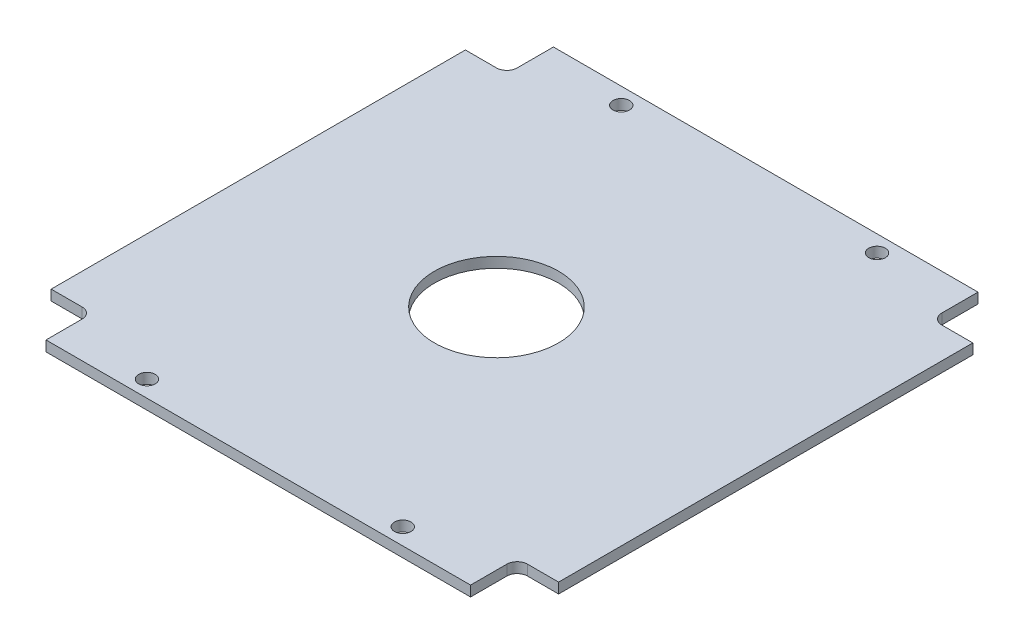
ISO-10303-21;
HEADER;
FILE_DESCRIPTION(('STEP AP214'),'2;1');
FILE_NAME('part.step','',(''),(''),'','','');
FILE_SCHEMA(('AUTOMOTIVE_DESIGN { 1 0 10303 214 1 1 1 1 }'));
ENDSEC;
DATA;
#1=APPLICATION_CONTEXT('core data for automotive mechanical design processes');
#2=APPLICATION_PROTOCOL_DEFINITION('international standard','automotive_design',2000,#1);
#3=PRODUCT_CONTEXT('',#1,'mechanical');
#4=PRODUCT('Part','Part','',(#3));
#5=PRODUCT_RELATED_PRODUCT_CATEGORY('part','',(#4));
#6=PRODUCT_DEFINITION_FORMATION('','',#4);
#7=PRODUCT_DEFINITION_CONTEXT('part definition',#1,'design');
#8=PRODUCT_DEFINITION('design','',#6,#7);
#9=PRODUCT_DEFINITION_SHAPE('','',#8);
#10=(LENGTH_UNIT() NAMED_UNIT(*) SI_UNIT(.MILLI.,.METRE.));
#11=(NAMED_UNIT(*) PLANE_ANGLE_UNIT() SI_UNIT($,.RADIAN.));
#12=(NAMED_UNIT(*) SI_UNIT($,.STERADIAN.) SOLID_ANGLE_UNIT());
#13=UNCERTAINTY_MEASURE_WITH_UNIT(LENGTH_MEASURE(1.E-05),#10,'distance_accuracy_value','');
#14=(GEOMETRIC_REPRESENTATION_CONTEXT(3) GLOBAL_UNCERTAINTY_ASSIGNED_CONTEXT((#13)) GLOBAL_UNIT_ASSIGNED_CONTEXT((#10,
#11,#12)) REPRESENTATION_CONTEXT('',''));
#15=CARTESIAN_POINT('',(0.,0.,0.));
#16=DIRECTION('',(0.,0.,1.));
#17=DIRECTION('',(1.,0.,0.));
#18=AXIS2_PLACEMENT_3D('',#15,#16,#17);
#19=CARTESIAN_POINT('',(-43.,2.,42.));
#20=DIRECTION('',(0.,-1.,0.));
#21=DIRECTION('',(0.,0.,-1.));
#22=AXIS2_PLACEMENT_3D('',#19,#20,#21);
#23=PLANE('',#22);
#24=CARTESIAN_POINT('',(-3.,2.,0.));
#25=DIRECTION('',(0.,-1.,0.));
#26=DIRECTION('',(0.,0.,-1.));
#27=AXIS2_PLACEMENT_3D('',#24,#25,#26);
#28=CIRCLE('',#27,12.);
#29=CARTESIAN_POINT('',(-3.,2.,-12.));
#30=VERTEX_POINT('',#29);
#31=EDGE_CURVE('E341',#30,#30,#28,.T.);
#32=ORIENTED_EDGE('',*,*,#31,.T.);
#33=EDGE_LOOP('',(#32));
#34=FACE_BOUND('',#33,.T.);
#35=DIRECTION('',(-1.,0.,0.));
#36=VECTOR('',#35,1.);
#37=CARTESIAN_POINT('',(-43.,2.,-40.));
#38=LINE('',#37,#36);
#39=CARTESIAN_POINT('',(-43.,2.,-40.));
#40=VERTEX_POINT('',#39);
#41=CARTESIAN_POINT('',(-49.,2.,-40.));
#42=VERTEX_POINT('',#41);
#43=EDGE_CURVE('E209',#40,#42,#38,.T.);
#44=ORIENTED_EDGE('',*,*,#43,.T.);
#45=DIRECTION('',(0.,0.,1.));
#46=VECTOR('',#45,1.);
#47=CARTESIAN_POINT('',(-49.,2.,-40.));
#48=LINE('',#47,#46);
#49=CARTESIAN_POINT('',(-49.,2.,40.));
#50=VERTEX_POINT('',#49);
#51=EDGE_CURVE('E117',#42,#50,#48,.T.);
#52=ORIENTED_EDGE('',*,*,#51,.T.);
#53=DIRECTION('',(1.,0.,0.));
#54=VECTOR('',#53,1.);
#55=CARTESIAN_POINT('',(-49.,2.,40.));
#56=LINE('',#55,#54);
#57=CARTESIAN_POINT('',(-43.,2.,40.));
#58=VERTEX_POINT('',#57);
#59=EDGE_CURVE('E248',#50,#58,#56,.T.);
#60=ORIENTED_EDGE('',*,*,#59,.T.);
#61=CARTESIAN_POINT('',(-43.,2.,42.));
#62=DIRECTION('',(0.,-1.,0.));
#63=DIRECTION('',(0.,0.,-1.));
#64=AXIS2_PLACEMENT_3D('',#61,#62,#63);
#65=CIRCLE('',#64,2.);
#66=CARTESIAN_POINT('',(-41.,2.,42.));
#67=VERTEX_POINT('',#66);
#68=EDGE_CURVE('E267',#58,#67,#65,.T.);
#69=ORIENTED_EDGE('',*,*,#68,.T.);
#70=DIRECTION('',(0.,0.,1.));
#71=VECTOR('',#70,1.);
#72=CARTESIAN_POINT('',(-41.,2.,42.));
#73=LINE('',#72,#71);
#74=CARTESIAN_POINT('',(-41.,2.,49.));
#75=VERTEX_POINT('',#74);
#76=EDGE_CURVE('E264',#67,#75,#73,.T.);
#77=ORIENTED_EDGE('',*,*,#76,.T.);
#78=DIRECTION('',(1.,0.,0.));
#79=VECTOR('',#78,1.);
#80=CARTESIAN_POINT('',(-41.,2.,49.));
#81=LINE('',#80,#79);
#82=CARTESIAN_POINT('',(41.,2.,49.));
#83=VERTEX_POINT('',#82);
#84=EDGE_CURVE('E266',#75,#83,#81,.T.);
#85=ORIENTED_EDGE('',*,*,#84,.T.);
#86=DIRECTION('',(0.,0.,-1.));
#87=VECTOR('',#86,1.);
#88=CARTESIAN_POINT('',(41.,2.,49.));
#89=LINE('',#88,#87);
#90=CARTESIAN_POINT('',(41.,2.,42.));
#91=VERTEX_POINT('',#90);
#92=EDGE_CURVE('E269',#83,#91,#89,.T.);
#93=ORIENTED_EDGE('',*,*,#92,.T.);
#94=CARTESIAN_POINT('',(43.,2.,42.));
#95=DIRECTION('',(0.,-1.,0.));
#96=DIRECTION('',(0.,0.,-1.));
#97=AXIS2_PLACEMENT_3D('',#94,#95,#96);
#98=CIRCLE('',#97,2.);
#99=CARTESIAN_POINT('',(43.,2.,40.));
#100=VERTEX_POINT('',#99);
#101=EDGE_CURVE('E275',#91,#100,#98,.T.);
#102=ORIENTED_EDGE('',*,*,#101,.T.);
#103=DIRECTION('',(1.,0.,0.));
#104=VECTOR('',#103,1.);
#105=CARTESIAN_POINT('',(43.,2.,40.));
#106=LINE('',#105,#104);
#107=CARTESIAN_POINT('',(49.,2.,40.));
#108=VERTEX_POINT('',#107);
#109=EDGE_CURVE('E277',#100,#108,#106,.T.);
#110=ORIENTED_EDGE('',*,*,#109,.T.);
#111=DIRECTION('',(0.,0.,-1.));
#112=VECTOR('',#111,1.);
#113=CARTESIAN_POINT('',(49.,2.,40.));
#114=LINE('',#113,#112);
#115=CARTESIAN_POINT('',(49.,2.,-40.));
#116=VERTEX_POINT('',#115);
#117=EDGE_CURVE('E279',#108,#116,#114,.T.);
#118=ORIENTED_EDGE('',*,*,#117,.T.);
#119=DIRECTION('',(-1.,0.,0.));
#120=VECTOR('',#119,1.);
#121=CARTESIAN_POINT('',(49.,2.,-40.));
#122=LINE('',#121,#120);
#123=CARTESIAN_POINT('',(43.,2.,-40.));
#124=VERTEX_POINT('',#123);
#125=EDGE_CURVE('E281',#116,#124,#122,.T.);
#126=ORIENTED_EDGE('',*,*,#125,.T.);
#127=CARTESIAN_POINT('',(43.,2.,-42.));
#128=DIRECTION('',(0.,-1.,0.));
#129=DIRECTION('',(0.,0.,-1.));
#130=AXIS2_PLACEMENT_3D('',#127,#128,#129);
#131=CIRCLE('',#130,2.);
#132=CARTESIAN_POINT('',(41.,2.,-42.));
#133=VERTEX_POINT('',#132);
#134=EDGE_CURVE('E283',#124,#133,#131,.T.);
#135=ORIENTED_EDGE('',*,*,#134,.T.);
#136=DIRECTION('',(0.,0.,-1.));
#137=VECTOR('',#136,1.);
#138=CARTESIAN_POINT('',(41.,2.,-42.));
#139=LINE('',#138,#137);
#140=CARTESIAN_POINT('',(41.,2.,-49.));
#141=VERTEX_POINT('',#140);
#142=EDGE_CURVE('E160',#133,#141,#139,.T.);
#143=ORIENTED_EDGE('',*,*,#142,.T.);
#144=DIRECTION('',(-1.,0.,0.));
#145=VECTOR('',#144,1.);
#146=CARTESIAN_POINT('',(41.,2.,-49.));
#147=LINE('',#146,#145);
#148=CARTESIAN_POINT('',(-41.,2.,-49.));
#149=VERTEX_POINT('',#148);
#150=EDGE_CURVE('E154',#141,#149,#147,.T.);
#151=ORIENTED_EDGE('',*,*,#150,.T.);
#152=DIRECTION('',(0.,0.,1.));
#153=VECTOR('',#152,1.);
#154=CARTESIAN_POINT('',(-41.,2.,-49.));
#155=LINE('',#154,#153);
#156=CARTESIAN_POINT('',(-41.,2.,-42.));
#157=VERTEX_POINT('',#156);
#158=EDGE_CURVE('E158',#149,#157,#155,.T.);
#159=ORIENTED_EDGE('',*,*,#158,.T.);
#160=CARTESIAN_POINT('',(-43.,2.,-42.));
#161=DIRECTION('',(0.,-1.,0.));
#162=DIRECTION('',(0.,0.,-1.));
#163=AXIS2_PLACEMENT_3D('',#160,#161,#162);
#164=CIRCLE('',#163,2.);
#165=EDGE_CURVE('E50',#157,#40,#164,.T.);
#166=ORIENTED_EDGE('',*,*,#165,.T.);
#167=EDGE_LOOP('',(#44,#52,#60,#69,#77,#85,#93,#102,#110,#118,#126,#135,#143,#151,#159,#166));
#168=FACE_BOUND('',#167,.T.);
#169=CARTESIAN_POINT('',(24.7,2.,45.8));
#170=DIRECTION('',(0.,1.,0.));
#171=DIRECTION('',(0.,0.,1.));
#172=AXIS2_PLACEMENT_3D('',#169,#170,#171);
#173=CIRCLE('',#172,1.59999999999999);
#174=CARTESIAN_POINT('',(24.7,2.,47.4));
#175=VERTEX_POINT('',#174);
#176=EDGE_CURVE('E363',#175,#175,#173,.T.);
#177=ORIENTED_EDGE('',*,*,#176,.F.);
#178=EDGE_LOOP('',(#177));
#179=FACE_BOUND('',#178,.T.);
#180=CARTESIAN_POINT('',(-24.7,2.,45.8));
#181=DIRECTION('',(0.,1.,0.));
#182=DIRECTION('',(0.,0.,1.));
#183=AXIS2_PLACEMENT_3D('',#180,#181,#182);
#184=CIRCLE('',#183,1.59999999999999);
#185=CARTESIAN_POINT('',(-24.7,2.,47.4));
#186=VERTEX_POINT('',#185);
#187=EDGE_CURVE('E357',#186,#186,#184,.T.);
#188=ORIENTED_EDGE('',*,*,#187,.F.);
#189=EDGE_LOOP('',(#188));
#190=FACE_BOUND('',#189,.T.);
#191=CARTESIAN_POINT('',(-24.7,2.,-45.8));
#192=DIRECTION('',(0.,1.,0.));
#193=DIRECTION('',(0.,0.,1.));
#194=AXIS2_PLACEMENT_3D('',#191,#192,#193);
#195=CIRCLE('',#194,1.59999999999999);
#196=CARTESIAN_POINT('',(-24.7,2.,-44.2));
#197=VERTEX_POINT('',#196);
#198=EDGE_CURVE('E351',#197,#197,#195,.T.);
#199=ORIENTED_EDGE('',*,*,#198,.F.);
#200=EDGE_LOOP('',(#199));
#201=FACE_BOUND('',#200,.T.);
#202=CARTESIAN_POINT('',(24.7,2.,-45.8));
#203=DIRECTION('',(0.,1.,0.));
#204=DIRECTION('',(0.,0.,1.));
#205=AXIS2_PLACEMENT_3D('',#202,#203,#204);
#206=CIRCLE('',#205,1.59999999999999);
#207=CARTESIAN_POINT('',(24.7,2.,-44.2));
#208=VERTEX_POINT('',#207);
#209=EDGE_CURVE('E342',#208,#208,#206,.T.);
#210=ORIENTED_EDGE('',*,*,#209,.F.);
#211=EDGE_LOOP('',(#210));
#212=FACE_BOUND('',#211,.T.);
#213=ADVANCED_FACE('F33',(#34,#168,#179,#190,#201,#212),#23,.F.);
#214=CARTESIAN_POINT('',(-43.,0.,42.));
#215=DIRECTION('',(0.,-1.,0.));
#216=DIRECTION('',(0.,0.,-1.));
#217=AXIS2_PLACEMENT_3D('',#214,#215,#216);
#218=PLANE('',#217);
#219=CARTESIAN_POINT('',(-3.,0.,0.));
#220=DIRECTION('',(0.,-1.,0.));
#221=DIRECTION('',(0.,0.,-1.));
#222=AXIS2_PLACEMENT_3D('',#219,#220,#221);
#223=CIRCLE('',#222,12.);
#224=CARTESIAN_POINT('',(-3.,0.,-12.));
#225=VERTEX_POINT('',#224);
#226=EDGE_CURVE('E339',#225,#225,#223,.T.);
#227=ORIENTED_EDGE('',*,*,#226,.F.);
#228=EDGE_LOOP('',(#227));
#229=FACE_BOUND('',#228,.T.);
#230=CARTESIAN_POINT('',(24.7,0.,-45.8));
#231=DIRECTION('',(0.,1.,0.));
#232=DIRECTION('',(0.,0.,1.));
#233=AXIS2_PLACEMENT_3D('',#230,#231,#232);
#234=CIRCLE('',#233,1.59999999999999);
#235=CARTESIAN_POINT('',(24.7,0.,-44.2));
#236=VERTEX_POINT('',#235);
#237=EDGE_CURVE('E345',#236,#236,#234,.T.);
#238=ORIENTED_EDGE('',*,*,#237,.T.);
#239=EDGE_LOOP('',(#238));
#240=FACE_BOUND('',#239,.T.);
#241=CARTESIAN_POINT('',(-24.7,0.,-45.8));
#242=DIRECTION('',(0.,1.,0.));
#243=DIRECTION('',(0.,0.,1.));
#244=AXIS2_PLACEMENT_3D('',#241,#242,#243);
#245=CIRCLE('',#244,1.59999999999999);
#246=CARTESIAN_POINT('',(-24.7,0.,-44.2));
#247=VERTEX_POINT('',#246);
#248=EDGE_CURVE('E354',#247,#247,#245,.T.);
#249=ORIENTED_EDGE('',*,*,#248,.T.);
#250=EDGE_LOOP('',(#249));
#251=FACE_BOUND('',#250,.T.);
#252=CARTESIAN_POINT('',(-24.7,0.,45.8));
#253=DIRECTION('',(0.,1.,0.));
#254=DIRECTION('',(0.,0.,1.));
#255=AXIS2_PLACEMENT_3D('',#252,#253,#254);
#256=CIRCLE('',#255,1.59999999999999);
#257=CARTESIAN_POINT('',(-24.7,0.,47.4));
#258=VERTEX_POINT('',#257);
#259=EDGE_CURVE('E360',#258,#258,#256,.T.);
#260=ORIENTED_EDGE('',*,*,#259,.T.);
#261=EDGE_LOOP('',(#260));
#262=FACE_BOUND('',#261,.T.);
#263=DIRECTION('',(-1.,0.,0.));
#264=VECTOR('',#263,1.);
#265=CARTESIAN_POINT('',(-43.,0.,-40.));
#266=LINE('',#265,#264);
#267=CARTESIAN_POINT('',(-43.,0.,-40.));
#268=VERTEX_POINT('',#267);
#269=CARTESIAN_POINT('',(-49.,0.,-40.));
#270=VERTEX_POINT('',#269);
#271=EDGE_CURVE('E178',#268,#270,#266,.T.);
#272=ORIENTED_EDGE('',*,*,#271,.F.);
#273=CARTESIAN_POINT('',(-43.,0.,-42.));
#274=DIRECTION('',(0.,-1.,0.));
#275=DIRECTION('',(0.,0.,-1.));
#276=AXIS2_PLACEMENT_3D('',#273,#274,#275);
#277=CIRCLE('',#276,2.);
#278=CARTESIAN_POINT('',(-41.,0.,-42.));
#279=VERTEX_POINT('',#278);
#280=EDGE_CURVE('E109',#279,#268,#277,.T.);
#281=ORIENTED_EDGE('',*,*,#280,.F.);
#282=DIRECTION('',(0.,0.,1.));
#283=VECTOR('',#282,1.);
#284=CARTESIAN_POINT('',(-41.,0.,-49.));
#285=LINE('',#284,#283);
#286=CARTESIAN_POINT('',(-41.,0.,-49.));
#287=VERTEX_POINT('',#286);
#288=EDGE_CURVE('E103',#287,#279,#285,.T.);
#289=ORIENTED_EDGE('',*,*,#288,.F.);
#290=DIRECTION('',(-1.,0.,0.));
#291=VECTOR('',#290,1.);
#292=CARTESIAN_POINT('',(41.,0.,-49.));
#293=LINE('',#292,#291);
#294=CARTESIAN_POINT('',(41.,0.,-49.));
#295=VERTEX_POINT('',#294);
#296=EDGE_CURVE('E168',#295,#287,#293,.T.);
#297=ORIENTED_EDGE('',*,*,#296,.F.);
#298=DIRECTION('',(0.,0.,-1.));
#299=VECTOR('',#298,1.);
#300=CARTESIAN_POINT('',(41.,0.,-42.));
#301=LINE('',#300,#299);
#302=CARTESIAN_POINT('',(41.,0.,-42.));
#303=VERTEX_POINT('',#302);
#304=EDGE_CURVE('E204',#303,#295,#301,.T.);
#305=ORIENTED_EDGE('',*,*,#304,.F.);
#306=CARTESIAN_POINT('',(43.,0.,-42.));
#307=DIRECTION('',(0.,-1.,0.));
#308=DIRECTION('',(0.,0.,-1.));
#309=AXIS2_PLACEMENT_3D('',#306,#307,#308);
#310=CIRCLE('',#309,2.);
#311=CARTESIAN_POINT('',(43.,0.,-40.));
#312=VERTEX_POINT('',#311);
#313=EDGE_CURVE('E202',#312,#303,#310,.T.);
#314=ORIENTED_EDGE('',*,*,#313,.F.);
#315=DIRECTION('',(-1.,0.,0.));
#316=VECTOR('',#315,1.);
#317=CARTESIAN_POINT('',(49.,0.,-40.));
#318=LINE('',#317,#316);
#319=CARTESIAN_POINT('',(49.,0.,-40.));
#320=VERTEX_POINT('',#319);
#321=EDGE_CURVE('E200',#320,#312,#318,.T.);
#322=ORIENTED_EDGE('',*,*,#321,.F.);
#323=DIRECTION('',(0.,0.,-1.));
#324=VECTOR('',#323,1.);
#325=CARTESIAN_POINT('',(49.,0.,40.));
#326=LINE('',#325,#324);
#327=CARTESIAN_POINT('',(49.,0.,40.));
#328=VERTEX_POINT('',#327);
#329=EDGE_CURVE('E198',#328,#320,#326,.T.);
#330=ORIENTED_EDGE('',*,*,#329,.F.);
#331=DIRECTION('',(1.,0.,0.));
#332=VECTOR('',#331,1.);
#333=CARTESIAN_POINT('',(43.,0.,40.));
#334=LINE('',#333,#332);
#335=CARTESIAN_POINT('',(43.,0.,40.));
#336=VERTEX_POINT('',#335);
#337=EDGE_CURVE('E196',#336,#328,#334,.T.);
#338=ORIENTED_EDGE('',*,*,#337,.F.);
#339=CARTESIAN_POINT('',(43.,0.,42.));
#340=DIRECTION('',(0.,-1.,0.));
#341=DIRECTION('',(0.,0.,-1.));
#342=AXIS2_PLACEMENT_3D('',#339,#340,#341);
#343=CIRCLE('',#342,2.);
#344=CARTESIAN_POINT('',(41.,0.,42.));
#345=VERTEX_POINT('',#344);
#346=EDGE_CURVE('E194',#345,#336,#343,.T.);
#347=ORIENTED_EDGE('',*,*,#346,.F.);
#348=DIRECTION('',(0.,0.,-1.));
#349=VECTOR('',#348,1.);
#350=CARTESIAN_POINT('',(41.,0.,49.));
#351=LINE('',#350,#349);
#352=CARTESIAN_POINT('',(41.,0.,49.));
#353=VERTEX_POINT('',#352);
#354=EDGE_CURVE('E192',#353,#345,#351,.T.);
#355=ORIENTED_EDGE('',*,*,#354,.F.);
#356=DIRECTION('',(1.,0.,0.));
#357=VECTOR('',#356,1.);
#358=CARTESIAN_POINT('',(-41.,0.,49.));
#359=LINE('',#358,#357);
#360=CARTESIAN_POINT('',(-41.,0.,49.));
#361=VERTEX_POINT('',#360);
#362=EDGE_CURVE('E190',#361,#353,#359,.T.);
#363=ORIENTED_EDGE('',*,*,#362,.F.);
#364=DIRECTION('',(0.,0.,1.));
#365=VECTOR('',#364,1.);
#366=CARTESIAN_POINT('',(-41.,0.,42.));
#367=LINE('',#366,#365);
#368=CARTESIAN_POINT('',(-41.,0.,42.));
#369=VERTEX_POINT('',#368);
#370=EDGE_CURVE('E188',#369,#361,#367,.T.);
#371=ORIENTED_EDGE('',*,*,#370,.F.);
#372=CARTESIAN_POINT('',(-43.,0.,42.));
#373=DIRECTION('',(0.,-1.,0.));
#374=DIRECTION('',(0.,0.,-1.));
#375=AXIS2_PLACEMENT_3D('',#372,#373,#374);
#376=CIRCLE('',#375,2.);
#377=CARTESIAN_POINT('',(-43.,0.,40.));
#378=VERTEX_POINT('',#377);
#379=EDGE_CURVE('E186',#378,#369,#376,.T.);
#380=ORIENTED_EDGE('',*,*,#379,.F.);
#381=DIRECTION('',(1.,0.,0.));
#382=VECTOR('',#381,1.);
#383=CARTESIAN_POINT('',(-49.,0.,40.));
#384=LINE('',#383,#382);
#385=CARTESIAN_POINT('',(-49.,0.,40.));
#386=VERTEX_POINT('',#385);
#387=EDGE_CURVE('E184',#386,#378,#384,.T.);
#388=ORIENTED_EDGE('',*,*,#387,.F.);
#389=DIRECTION('',(0.,0.,1.));
#390=VECTOR('',#389,1.);
#391=CARTESIAN_POINT('',(-49.,0.,-40.));
#392=LINE('',#391,#390);
#393=EDGE_CURVE('E181',#270,#386,#392,.T.);
#394=ORIENTED_EDGE('',*,*,#393,.F.);
#395=EDGE_LOOP('',(#272,#281,#289,#297,#305,#314,#322,#330,#338,#347,#355,#363,#371,#380,#388,#394));
#396=FACE_BOUND('',#395,.T.);
#397=CARTESIAN_POINT('',(24.7,0.,45.8));
#398=DIRECTION('',(0.,1.,0.));
#399=DIRECTION('',(0.,0.,1.));
#400=AXIS2_PLACEMENT_3D('',#397,#398,#399);
#401=CIRCLE('',#400,1.59999999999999);
#402=CARTESIAN_POINT('',(24.7,0.,47.4));
#403=VERTEX_POINT('',#402);
#404=EDGE_CURVE('E182',#403,#403,#401,.T.);
#405=ORIENTED_EDGE('',*,*,#404,.T.);
#406=EDGE_LOOP('',(#405));
#407=FACE_BOUND('',#406,.T.);
#408=ADVANCED_FACE('F252',(#229,#240,#251,#262,#396,#407),#218,.T.);
#409=CARTESIAN_POINT('',(-43.,2.,-40.));
#410=DIRECTION('',(0.,0.,1.));
#411=DIRECTION('',(1.,0.,0.));
#412=AXIS2_PLACEMENT_3D('',#409,#410,#411);
#413=PLANE('',#412);
#414=ORIENTED_EDGE('',*,*,#271,.T.);
#415=DIRECTION('',(0.,-1.,0.));
#416=VECTOR('',#415,1.);
#417=CARTESIAN_POINT('',(-49.,2.,-40.));
#418=LINE('',#417,#416);
#419=EDGE_CURVE('E11',#42,#270,#418,.T.);
#420=ORIENTED_EDGE('',*,*,#419,.F.);
#421=ORIENTED_EDGE('',*,*,#43,.F.);
#422=DIRECTION('',(0.,-1.,0.));
#423=VECTOR('',#422,1.);
#424=CARTESIAN_POINT('',(-43.,2.,-40.));
#425=LINE('',#424,#423);
#426=EDGE_CURVE('E174',#40,#268,#425,.T.);
#427=ORIENTED_EDGE('',*,*,#426,.T.);
#428=EDGE_LOOP('',(#414,#420,#421,#427));
#429=FACE_BOUND('',#428,.T.);
#430=ADVANCED_FACE('F35',(#429),#413,.F.);
#431=CARTESIAN_POINT('',(-49.,2.,-40.));
#432=DIRECTION('',(1.,0.,0.));
#433=DIRECTION('',(0.,0.,-1.));
#434=AXIS2_PLACEMENT_3D('',#431,#432,#433);
#435=PLANE('',#434);
#436=ORIENTED_EDGE('',*,*,#393,.T.);
#437=DIRECTION('',(0.,-1.,0.));
#438=VECTOR('',#437,1.);
#439=CARTESIAN_POINT('',(-49.,2.,40.));
#440=LINE('',#439,#438);
#441=EDGE_CURVE('E42',#50,#386,#440,.T.);
#442=ORIENTED_EDGE('',*,*,#441,.F.);
#443=ORIENTED_EDGE('',*,*,#51,.F.);
#444=ORIENTED_EDGE('',*,*,#419,.T.);
#445=EDGE_LOOP('',(#436,#442,#443,#444));
#446=FACE_BOUND('',#445,.T.);
#447=ADVANCED_FACE('F523',(#446),#435,.F.);
#448=CARTESIAN_POINT('',(-49.,2.,40.));
#449=DIRECTION('',(0.,0.,-1.));
#450=DIRECTION('',(-1.,0.,0.));
#451=AXIS2_PLACEMENT_3D('',#448,#449,#450);
#452=PLANE('',#451);
#453=ORIENTED_EDGE('',*,*,#387,.T.);
#454=DIRECTION('',(0.,-1.,0.));
#455=VECTOR('',#454,1.);
#456=CARTESIAN_POINT('',(-43.,2.,40.));
#457=LINE('',#456,#455);
#458=EDGE_CURVE('E240',#58,#378,#457,.T.);
#459=ORIENTED_EDGE('',*,*,#458,.F.);
#460=ORIENTED_EDGE('',*,*,#59,.F.);
#461=ORIENTED_EDGE('',*,*,#441,.T.);
#462=EDGE_LOOP('',(#453,#459,#460,#461));
#463=FACE_BOUND('',#462,.T.);
#464=ADVANCED_FACE('F246',(#463),#452,.F.);
#465=CARTESIAN_POINT('',(-43.,2.,42.));
#466=DIRECTION('',(0.,-1.,0.));
#467=DIRECTION('',(0.,0.,-1.));
#468=AXIS2_PLACEMENT_3D('',#465,#466,#467);
#469=CYLINDRICAL_SURFACE('',#468,2.);
#470=ORIENTED_EDGE('',*,*,#379,.T.);
#471=DIRECTION('',(0.,-1.,0.));
#472=VECTOR('',#471,1.);
#473=CARTESIAN_POINT('',(-41.,2.,42.));
#474=LINE('',#473,#472);
#475=EDGE_CURVE('E237',#67,#369,#474,.T.);
#476=ORIENTED_EDGE('',*,*,#475,.F.);
#477=ORIENTED_EDGE('',*,*,#68,.F.);
#478=ORIENTED_EDGE('',*,*,#458,.T.);
#479=EDGE_LOOP('',(#470,#476,#477,#478));
#480=FACE_BOUND('',#479,.T.);
#481=ADVANCED_FACE('F258',(#480),#469,.F.);
#482=CARTESIAN_POINT('',(-41.,2.,42.));
#483=DIRECTION('',(1.,0.,0.));
#484=DIRECTION('',(0.,0.,-1.));
#485=AXIS2_PLACEMENT_3D('',#482,#483,#484);
#486=PLANE('',#485);
#487=ORIENTED_EDGE('',*,*,#370,.T.);
#488=DIRECTION('',(0.,-1.,0.));
#489=VECTOR('',#488,1.);
#490=CARTESIAN_POINT('',(-41.,2.,49.));
#491=LINE('',#490,#489);
#492=EDGE_CURVE('E234',#75,#361,#491,.T.);
#493=ORIENTED_EDGE('',*,*,#492,.F.);
#494=ORIENTED_EDGE('',*,*,#76,.F.);
#495=ORIENTED_EDGE('',*,*,#475,.T.);
#496=EDGE_LOOP('',(#487,#493,#494,#495));
#497=FACE_BOUND('',#496,.T.);
#498=ADVANCED_FACE('F262',(#497),#486,.F.);
#499=CARTESIAN_POINT('',(-41.,2.,49.));
#500=DIRECTION('',(0.,0.,-1.));
#501=DIRECTION('',(-1.,0.,0.));
#502=AXIS2_PLACEMENT_3D('',#499,#500,#501);
#503=PLANE('',#502);
#504=ORIENTED_EDGE('',*,*,#362,.T.);
#505=DIRECTION('',(0.,-1.,0.));
#506=VECTOR('',#505,1.);
#507=CARTESIAN_POINT('',(41.,2.,49.));
#508=LINE('',#507,#506);
#509=EDGE_CURVE('E231',#83,#353,#508,.T.);
#510=ORIENTED_EDGE('',*,*,#509,.F.);
#511=ORIENTED_EDGE('',*,*,#84,.F.);
#512=ORIENTED_EDGE('',*,*,#492,.T.);
#513=EDGE_LOOP('',(#504,#510,#511,#512));
#514=FACE_BOUND('',#513,.T.);
#515=ADVANCED_FACE('F488',(#514),#503,.F.);
#516=CARTESIAN_POINT('',(41.,2.,49.));
#517=DIRECTION('',(-1.,0.,0.));
#518=DIRECTION('',(0.,0.,1.));
#519=AXIS2_PLACEMENT_3D('',#516,#517,#518);
#520=PLANE('',#519);
#521=ORIENTED_EDGE('',*,*,#354,.T.);
#522=DIRECTION('',(0.,-1.,0.));
#523=VECTOR('',#522,1.);
#524=CARTESIAN_POINT('',(41.,2.,42.));
#525=LINE('',#524,#523);
#526=EDGE_CURVE('E228',#91,#345,#525,.T.);
#527=ORIENTED_EDGE('',*,*,#526,.F.);
#528=ORIENTED_EDGE('',*,*,#92,.F.);
#529=ORIENTED_EDGE('',*,*,#509,.T.);
#530=EDGE_LOOP('',(#521,#527,#528,#529));
#531=FACE_BOUND('',#530,.T.);
#532=ADVANCED_FACE('F478',(#531),#520,.F.);
#533=CARTESIAN_POINT('',(43.,2.,42.));
#534=DIRECTION('',(0.,-1.,0.));
#535=DIRECTION('',(0.,0.,-1.));
#536=AXIS2_PLACEMENT_3D('',#533,#534,#535);
#537=CYLINDRICAL_SURFACE('',#536,2.);
#538=ORIENTED_EDGE('',*,*,#346,.T.);
#539=DIRECTION('',(0.,-1.,0.));
#540=VECTOR('',#539,1.);
#541=CARTESIAN_POINT('',(43.,2.,40.));
#542=LINE('',#541,#540);
#543=EDGE_CURVE('E225',#100,#336,#542,.T.);
#544=ORIENTED_EDGE('',*,*,#543,.F.);
#545=ORIENTED_EDGE('',*,*,#101,.F.);
#546=ORIENTED_EDGE('',*,*,#526,.T.);
#547=EDGE_LOOP('',(#538,#544,#545,#546));
#548=FACE_BOUND('',#547,.T.);
#549=ADVANCED_FACE('F468',(#548),#537,.F.);
#550=CARTESIAN_POINT('',(43.,2.,40.));
#551=DIRECTION('',(0.,0.,-1.));
#552=DIRECTION('',(-1.,0.,0.));
#553=AXIS2_PLACEMENT_3D('',#550,#551,#552);
#554=PLANE('',#553);
#555=ORIENTED_EDGE('',*,*,#337,.T.);
#556=DIRECTION('',(0.,-1.,0.));
#557=VECTOR('',#556,1.);
#558=CARTESIAN_POINT('',(49.,2.,40.));
#559=LINE('',#558,#557);
#560=EDGE_CURVE('E222',#108,#328,#559,.T.);
#561=ORIENTED_EDGE('',*,*,#560,.F.);
#562=ORIENTED_EDGE('',*,*,#109,.F.);
#563=ORIENTED_EDGE('',*,*,#543,.T.);
#564=EDGE_LOOP('',(#555,#561,#562,#563));
#565=FACE_BOUND('',#564,.T.);
#566=ADVANCED_FACE('F458',(#565),#554,.F.);
#567=CARTESIAN_POINT('',(49.,2.,40.));
#568=DIRECTION('',(-1.,0.,0.));
#569=DIRECTION('',(0.,0.,1.));
#570=AXIS2_PLACEMENT_3D('',#567,#568,#569);
#571=PLANE('',#570);
#572=ORIENTED_EDGE('',*,*,#329,.T.);
#573=DIRECTION('',(0.,-1.,0.));
#574=VECTOR('',#573,1.);
#575=CARTESIAN_POINT('',(49.,2.,-40.));
#576=LINE('',#575,#574);
#577=EDGE_CURVE('E219',#116,#320,#576,.T.);
#578=ORIENTED_EDGE('',*,*,#577,.F.);
#579=ORIENTED_EDGE('',*,*,#117,.F.);
#580=ORIENTED_EDGE('',*,*,#560,.T.);
#581=EDGE_LOOP('',(#572,#578,#579,#580));
#582=FACE_BOUND('',#581,.T.);
#583=ADVANCED_FACE('F448',(#582),#571,.F.);
#584=CARTESIAN_POINT('',(49.,2.,-40.));
#585=DIRECTION('',(0.,0.,1.));
#586=DIRECTION('',(1.,0.,0.));
#587=AXIS2_PLACEMENT_3D('',#584,#585,#586);
#588=PLANE('',#587);
#589=ORIENTED_EDGE('',*,*,#321,.T.);
#590=DIRECTION('',(0.,-1.,0.));
#591=VECTOR('',#590,1.);
#592=CARTESIAN_POINT('',(43.,2.,-40.));
#593=LINE('',#592,#591);
#594=EDGE_CURVE('E216',#124,#312,#593,.T.);
#595=ORIENTED_EDGE('',*,*,#594,.F.);
#596=ORIENTED_EDGE('',*,*,#125,.F.);
#597=ORIENTED_EDGE('',*,*,#577,.T.);
#598=EDGE_LOOP('',(#589,#595,#596,#597));
#599=FACE_BOUND('',#598,.T.);
#600=ADVANCED_FACE('F439',(#599),#588,.F.);
#601=CARTESIAN_POINT('',(43.,2.,-42.));
#602=DIRECTION('',(0.,-1.,0.));
#603=DIRECTION('',(0.,0.,-1.));
#604=AXIS2_PLACEMENT_3D('',#601,#602,#603);
#605=CYLINDRICAL_SURFACE('',#604,2.);
#606=ORIENTED_EDGE('',*,*,#313,.T.);
#607=DIRECTION('',(0.,-1.,0.));
#608=VECTOR('',#607,1.);
#609=CARTESIAN_POINT('',(41.,2.,-42.));
#610=LINE('',#609,#608);
#611=EDGE_CURVE('E213',#133,#303,#610,.T.);
#612=ORIENTED_EDGE('',*,*,#611,.F.);
#613=ORIENTED_EDGE('',*,*,#134,.F.);
#614=ORIENTED_EDGE('',*,*,#594,.T.);
#615=EDGE_LOOP('',(#606,#612,#613,#614));
#616=FACE_BOUND('',#615,.T.);
#617=ADVANCED_FACE('F289',(#616),#605,.F.);
#618=CARTESIAN_POINT('',(41.,2.,-42.));
#619=DIRECTION('',(-1.,0.,0.));
#620=DIRECTION('',(0.,0.,1.));
#621=AXIS2_PLACEMENT_3D('',#618,#619,#620);
#622=PLANE('',#621);
#623=ORIENTED_EDGE('',*,*,#304,.T.);
#624=DIRECTION('',(0.,-1.,0.));
#625=VECTOR('',#624,1.);
#626=CARTESIAN_POINT('',(41.,2.,-49.));
#627=LINE('',#626,#625);
#628=EDGE_CURVE('E169',#141,#295,#627,.T.);
#629=ORIENTED_EDGE('',*,*,#628,.F.);
#630=ORIENTED_EDGE('',*,*,#142,.F.);
#631=ORIENTED_EDGE('',*,*,#611,.T.);
#632=EDGE_LOOP('',(#623,#629,#630,#631));
#633=FACE_BOUND('',#632,.T.);
#634=ADVANCED_FACE('F293',(#633),#622,.F.);
#635=CARTESIAN_POINT('',(41.,2.,-49.));
#636=DIRECTION('',(0.,0.,1.));
#637=DIRECTION('',(1.,0.,0.));
#638=AXIS2_PLACEMENT_3D('',#635,#636,#637);
#639=PLANE('',#638);
#640=ORIENTED_EDGE('',*,*,#296,.T.);
#641=DIRECTION('',(0.,-1.,0.));
#642=VECTOR('',#641,1.);
#643=CARTESIAN_POINT('',(-41.,2.,-49.));
#644=LINE('',#643,#642);
#645=EDGE_CURVE('E165',#149,#287,#644,.T.);
#646=ORIENTED_EDGE('',*,*,#645,.F.);
#647=ORIENTED_EDGE('',*,*,#150,.F.);
#648=ORIENTED_EDGE('',*,*,#628,.T.);
#649=EDGE_LOOP('',(#640,#646,#647,#648));
#650=FACE_BOUND('',#649,.T.);
#651=ADVANCED_FACE('F166',(#650),#639,.F.);
#652=CARTESIAN_POINT('',(-41.,2.,-49.));
#653=DIRECTION('',(1.,0.,0.));
#654=DIRECTION('',(0.,0.,-1.));
#655=AXIS2_PLACEMENT_3D('',#652,#653,#654);
#656=PLANE('',#655);
#657=ORIENTED_EDGE('',*,*,#288,.T.);
#658=DIRECTION('',(0.,-1.,0.));
#659=VECTOR('',#658,1.);
#660=CARTESIAN_POINT('',(-41.,2.,-42.));
#661=LINE('',#660,#659);
#662=EDGE_CURVE('E170',#157,#279,#661,.T.);
#663=ORIENTED_EDGE('',*,*,#662,.F.);
#664=ORIENTED_EDGE('',*,*,#158,.F.);
#665=ORIENTED_EDGE('',*,*,#645,.T.);
#666=EDGE_LOOP('',(#657,#663,#664,#665));
#667=FACE_BOUND('',#666,.T.);
#668=ADVANCED_FACE('F172',(#667),#656,.F.);
#669=CARTESIAN_POINT('',(-43.,2.,-42.));
#670=DIRECTION('',(0.,-1.,0.));
#671=DIRECTION('',(0.,0.,-1.));
#672=AXIS2_PLACEMENT_3D('',#669,#670,#671);
#673=CYLINDRICAL_SURFACE('',#672,2.);
#674=ORIENTED_EDGE('',*,*,#280,.T.);
#675=ORIENTED_EDGE('',*,*,#426,.F.);
#676=ORIENTED_EDGE('',*,*,#165,.F.);
#677=ORIENTED_EDGE('',*,*,#662,.T.);
#678=EDGE_LOOP('',(#674,#675,#676,#677));
#679=FACE_BOUND('',#678,.T.);
#680=ADVANCED_FACE('F297',(#679),#673,.F.);
#681=CARTESIAN_POINT('',(24.7,2.,45.8));
#682=DIRECTION('',(0.,1.,0.));
#683=DIRECTION('',(0.,0.,1.));
#684=AXIS2_PLACEMENT_3D('',#681,#682,#683);
#685=CYLINDRICAL_SURFACE('',#684,1.59999999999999);
#686=ORIENTED_EDGE('',*,*,#404,.F.);
#687=EDGE_LOOP('',(#686));
#688=FACE_BOUND('',#687,.T.);
#689=ORIENTED_EDGE('',*,*,#176,.T.);
#690=EDGE_LOOP('',(#689));
#691=FACE_BOUND('',#690,.T.);
#692=ADVANCED_FACE('F299',(#688,#691),#685,.F.);
#693=CARTESIAN_POINT('',(-24.7,2.,45.8));
#694=DIRECTION('',(0.,1.,0.));
#695=DIRECTION('',(0.,0.,1.));
#696=AXIS2_PLACEMENT_3D('',#693,#694,#695);
#697=CYLINDRICAL_SURFACE('',#696,1.59999999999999);
#698=ORIENTED_EDGE('',*,*,#259,.F.);
#699=EDGE_LOOP('',(#698));
#700=FACE_BOUND('',#699,.T.);
#701=ORIENTED_EDGE('',*,*,#187,.T.);
#702=EDGE_LOOP('',(#701));
#703=FACE_BOUND('',#702,.T.);
#704=ADVANCED_FACE('F305',(#700,#703),#697,.F.);
#705=CARTESIAN_POINT('',(-24.7,2.,-45.8));
#706=DIRECTION('',(0.,1.,0.));
#707=DIRECTION('',(0.,0.,1.));
#708=AXIS2_PLACEMENT_3D('',#705,#706,#707);
#709=CYLINDRICAL_SURFACE('',#708,1.59999999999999);
#710=ORIENTED_EDGE('',*,*,#248,.F.);
#711=EDGE_LOOP('',(#710));
#712=FACE_BOUND('',#711,.T.);
#713=ORIENTED_EDGE('',*,*,#198,.T.);
#714=EDGE_LOOP('',(#713));
#715=FACE_BOUND('',#714,.T.);
#716=ADVANCED_FACE('F322',(#712,#715),#709,.F.);
#717=CARTESIAN_POINT('',(24.7,2.,-45.8));
#718=DIRECTION('',(0.,1.,0.));
#719=DIRECTION('',(0.,0.,1.));
#720=AXIS2_PLACEMENT_3D('',#717,#718,#719);
#721=CYLINDRICAL_SURFACE('',#720,1.59999999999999);
#722=ORIENTED_EDGE('',*,*,#237,.F.);
#723=EDGE_LOOP('',(#722));
#724=FACE_BOUND('',#723,.T.);
#725=ORIENTED_EDGE('',*,*,#209,.T.);
#726=EDGE_LOOP('',(#725));
#727=FACE_BOUND('',#726,.T.);
#728=ADVANCED_FACE('F326',(#724,#727),#721,.F.);
#729=CARTESIAN_POINT('',(-3.,10.,0.));
#730=DIRECTION('',(0.,-1.,0.));
#731=DIRECTION('',(0.,0.,-1.));
#732=AXIS2_PLACEMENT_3D('',#729,#730,#731);
#733=CYLINDRICAL_SURFACE('',#732,12.);
#734=ORIENTED_EDGE('',*,*,#226,.T.);
#735=EDGE_LOOP('',(#734));
#736=FACE_BOUND('',#735,.T.);
#737=ORIENTED_EDGE('',*,*,#31,.F.);
#738=EDGE_LOOP('',(#737));
#739=FACE_BOUND('',#738,.T.);
#740=ADVANCED_FACE('F330',(#736,#739),#733,.F.);
#741=CLOSED_SHELL('',(#213,#408,#430,#447,#464,#481,#498,#515,#532,#549,#566,#583,#600,#617,
#634,#651,#668,#680,#692,#704,#716,#728,#740));
#742=MANIFOLD_SOLID_BREP('B2',#741);
#743=ADVANCED_BREP_SHAPE_REPRESENTATION('',(#18,#742),#14);
#744=SHAPE_DEFINITION_REPRESENTATION(#9,#743);
ENDSEC;
END-ISO-10303-21;
